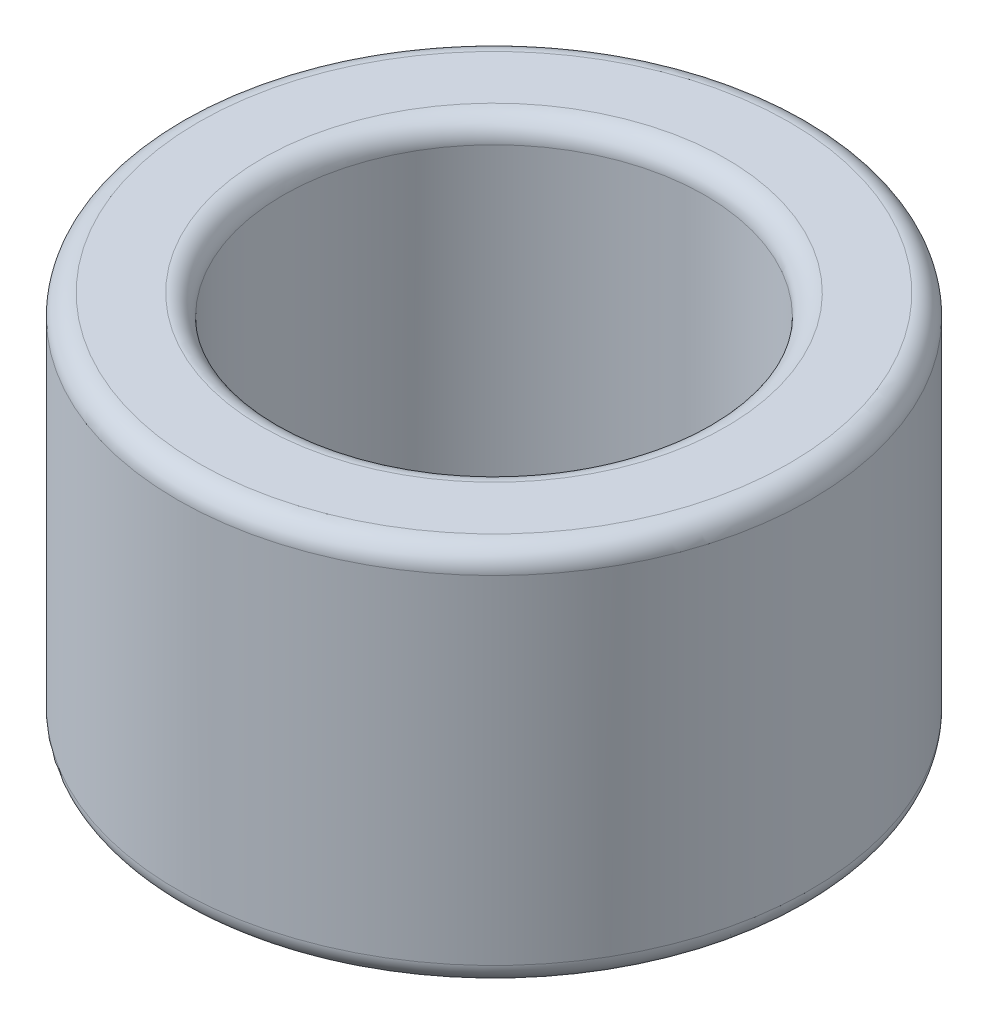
from build123d import *

# Parameters (mm, degrees)
SKETCH1_W = 1.25
SKETCH1_H = 4.5
FILLET1_R = 0.25


with BuildPart() as part:
    # Sketch1 → Revolve1 (revolve)
    with BuildSketch(Plane.XY, mode=Mode.PRIVATE) as revolve1_sk:
        with Locations((3.125, 2.25)):
            Rectangle(SKETCH1_W, SKETCH1_H)
    revolve(revolve1_sk.sketch.rotate(Axis((0, 0, 0), (0, 1, 0)), 90), axis=Axis((0, 0, 0), (0, 1, 0)))

    # Fillet1
    fillet1_edges = [part.edges().sort_by_distance(p)[0] for p in [
        (0, 0, 2.5),
        (0, 0, 3.75),
        (0, 4.5, 3.75),
        (0, 4.5, 2.5),
    ]]
    fillet(fillet1_edges, radius=FILLET1_R)


solid = part.part
